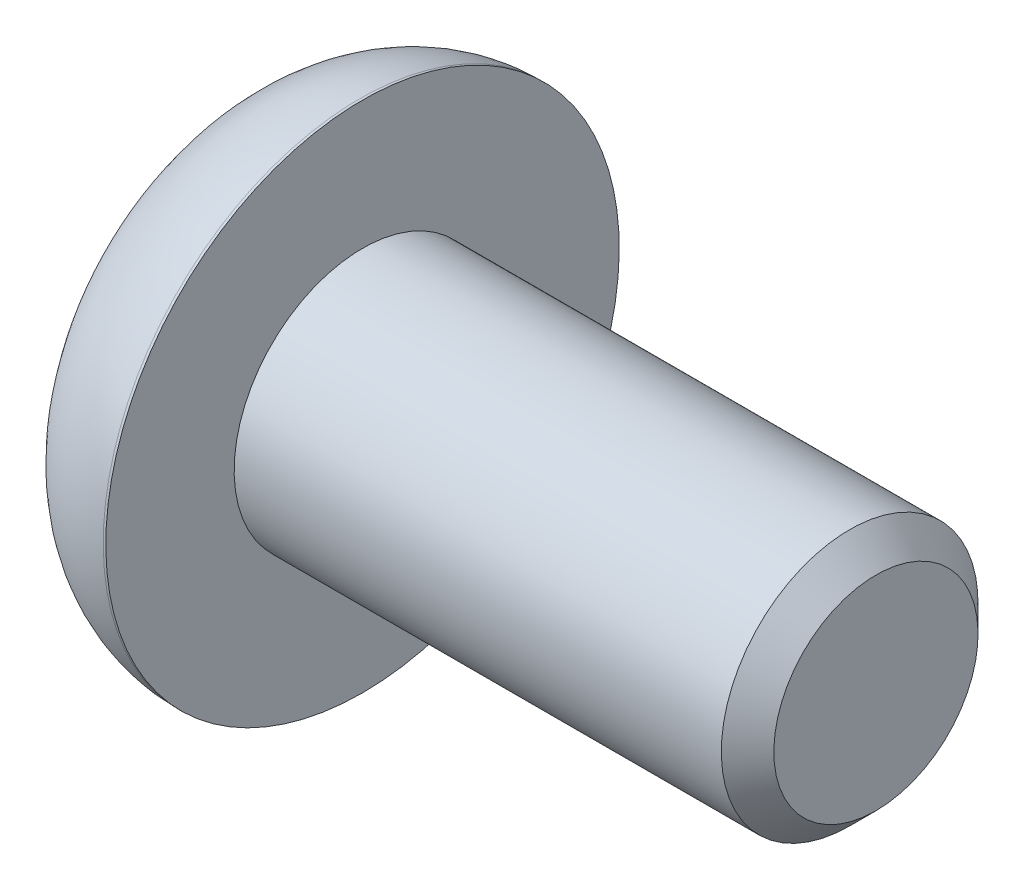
ISO-10303-21;
HEADER;
FILE_DESCRIPTION(('STEP AP214'),'2;1');
FILE_NAME('part.step','',(''),(''),'','','');
FILE_SCHEMA(('AUTOMOTIVE_DESIGN { 1 0 10303 214 1 1 1 1 }'));
ENDSEC;
DATA;
#1=APPLICATION_CONTEXT('core data for automotive mechanical design processes');
#2=APPLICATION_PROTOCOL_DEFINITION('international standard','automotive_design',2000,#1);
#3=PRODUCT_CONTEXT('',#1,'mechanical');
#4=PRODUCT('Part','Part','',(#3));
#5=PRODUCT_RELATED_PRODUCT_CATEGORY('part','',(#4));
#6=PRODUCT_DEFINITION_FORMATION('','',#4);
#7=PRODUCT_DEFINITION_CONTEXT('part definition',#1,'design');
#8=PRODUCT_DEFINITION('design','',#6,#7);
#9=PRODUCT_DEFINITION_SHAPE('','',#8);
#10=(LENGTH_UNIT() NAMED_UNIT(*) SI_UNIT(.MILLI.,.METRE.));
#11=(NAMED_UNIT(*) PLANE_ANGLE_UNIT() SI_UNIT($,.RADIAN.));
#12=(NAMED_UNIT(*) SI_UNIT($,.STERADIAN.) SOLID_ANGLE_UNIT());
#13=UNCERTAINTY_MEASURE_WITH_UNIT(LENGTH_MEASURE(1.E-05),#10,'distance_accuracy_value','');
#14=(GEOMETRIC_REPRESENTATION_CONTEXT(3) GLOBAL_UNCERTAINTY_ASSIGNED_CONTEXT((#13)) GLOBAL_UNIT_ASSIGNED_CONTEXT((#10,
#11,#12)) REPRESENTATION_CONTEXT('',''));
#15=CARTESIAN_POINT('',(0.,0.,0.));
#16=DIRECTION('',(0.,0.,1.));
#17=DIRECTION('',(1.,0.,0.));
#18=AXIS2_PLACEMENT_3D('',#15,#16,#17);
#19=CARTESIAN_POINT('',(0.,0.,0.));
#20=DIRECTION('',(1.,0.,0.));
#21=DIRECTION('',(0.,1.,0.));
#22=AXIS2_PLACEMENT_3D('',#19,#20,#21);
#23=PLANE('',#22);
#24=CARTESIAN_POINT('',(0.,0.,0.));
#25=DIRECTION('',(-1.,0.,0.));
#26=DIRECTION('',(0.,-1.,0.));
#27=AXIS2_PLACEMENT_3D('',#24,#25,#26);
#28=CIRCLE('',#27,2.76);
#29=CARTESIAN_POINT('',(0.,-2.76,0.));
#30=VERTEX_POINT('',#29);
#31=EDGE_CURVE('E162',#30,#30,#28,.T.);
#32=ORIENTED_EDGE('',*,*,#31,.T.);
#33=EDGE_LOOP('',(#32));
#34=FACE_BOUND('',#33,.T.);
#35=DIRECTION('',(0.,-0.5,-0.866025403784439));
#36=VECTOR('',#35,1.);
#37=CARTESIAN_POINT('',(0.,-1.15470053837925,2.));
#38=LINE('',#37,#36);
#39=CARTESIAN_POINT('',(0.,-1.15470053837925,2.));
#40=VERTEX_POINT('',#39);
#41=CARTESIAN_POINT('',(0.,-2.3094010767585,0.));
#42=VERTEX_POINT('',#41);
#43=EDGE_CURVE('E212',#40,#42,#38,.T.);
#44=ORIENTED_EDGE('',*,*,#43,.T.);
#45=DIRECTION('',(0.,0.5,-0.866025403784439));
#46=VECTOR('',#45,1.);
#47=CARTESIAN_POINT('',(0.,-2.3094010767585,0.));
#48=LINE('',#47,#46);
#49=CARTESIAN_POINT('',(0.,-1.15470053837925,-2.));
#50=VERTEX_POINT('',#49);
#51=EDGE_CURVE('E214',#42,#50,#48,.T.);
#52=ORIENTED_EDGE('',*,*,#51,.T.);
#53=DIRECTION('',(0.,1.,0.));
#54=VECTOR('',#53,1.);
#55=CARTESIAN_POINT('',(0.,-1.15470053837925,-2.));
#56=LINE('',#55,#54);
#57=CARTESIAN_POINT('',(0.,1.15470053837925,-2.));
#58=VERTEX_POINT('',#57);
#59=EDGE_CURVE('E216',#50,#58,#56,.T.);
#60=ORIENTED_EDGE('',*,*,#59,.T.);
#61=DIRECTION('',(0.,0.5,0.866025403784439));
#62=VECTOR('',#61,1.);
#63=CARTESIAN_POINT('',(0.,1.15470053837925,-2.));
#64=LINE('',#63,#62);
#65=CARTESIAN_POINT('',(0.,2.3094010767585,0.));
#66=VERTEX_POINT('',#65);
#67=EDGE_CURVE('E123',#58,#66,#64,.T.);
#68=ORIENTED_EDGE('',*,*,#67,.T.);
#69=DIRECTION('',(0.,-0.5,0.866025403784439));
#70=VECTOR('',#69,1.);
#71=CARTESIAN_POINT('',(0.,2.3094010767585,0.));
#72=LINE('',#71,#70);
#73=CARTESIAN_POINT('',(0.,1.15470053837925,2.));
#74=VERTEX_POINT('',#73);
#75=EDGE_CURVE('E209',#66,#74,#72,.T.);
#76=ORIENTED_EDGE('',*,*,#75,.T.);
#77=DIRECTION('',(0.,-1.,0.));
#78=VECTOR('',#77,1.);
#79=CARTESIAN_POINT('',(0.,1.15470053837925,2.));
#80=LINE('',#79,#78);
#81=EDGE_CURVE('E138',#74,#40,#80,.T.);
#82=ORIENTED_EDGE('',*,*,#81,.T.);
#83=EDGE_LOOP('',(#44,#52,#60,#68,#76,#82));
#84=FACE_BOUND('',#83,.T.);
#85=ADVANCED_FACE('F40',(#34,#84),#23,.F.);
#86=CARTESIAN_POINT('',(3.24000000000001,0.,0.));
#87=DIRECTION('',(-1.,0.,0.));
#88=DIRECTION('',(0.,-1.,0.));
#89=AXIS2_PLACEMENT_3D('',#86,#87,#88);
#90=DEGENERATE_TOROIDAL_SURFACE('',#89,2.75999999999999,3.24000000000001,.T.);
#91=ORIENTED_EDGE('',*,*,#31,.F.);
#92=EDGE_LOOP('',(#91));
#93=FACE_BOUND('',#92,.T.);
#94=CARTESIAN_POINT('',(3.24,0.,0.));
#95=DIRECTION('',(-1.,0.,0.));
#96=DIRECTION('',(0.,-1.,0.));
#97=AXIS2_PLACEMENT_3D('',#94,#95,#96);
#98=CIRCLE('',#97,6.);
#99=CARTESIAN_POINT('',(3.24,-6.,0.));
#100=VERTEX_POINT('',#99);
#101=EDGE_CURVE('E160',#100,#100,#98,.T.);
#102=ORIENTED_EDGE('',*,*,#101,.T.);
#103=EDGE_LOOP('',(#102));
#104=FACE_BOUND('',#103,.T.);
#105=ADVANCED_FACE('F250',(#93,#104),#90,.T.);
#106=CARTESIAN_POINT('',(15.3,0.,0.));
#107=DIRECTION('',(-1.,0.,0.));
#108=DIRECTION('',(0.,-1.,0.));
#109=AXIS2_PLACEMENT_3D('',#106,#107,#108);
#110=CYLINDRICAL_SURFACE('',#109,6.);
#111=ORIENTED_EDGE('',*,*,#101,.F.);
#112=EDGE_LOOP('',(#111));
#113=FACE_BOUND('',#112,.T.);
#114=CARTESIAN_POINT('',(3.3,0.,0.));
#115=DIRECTION('',(-1.,0.,0.));
#116=DIRECTION('',(0.,-1.,0.));
#117=AXIS2_PLACEMENT_3D('',#114,#115,#116);
#118=CIRCLE('',#117,6.);
#119=CARTESIAN_POINT('',(3.3,-6.,0.));
#120=VERTEX_POINT('',#119);
#121=EDGE_CURVE('E157',#120,#120,#118,.T.);
#122=ORIENTED_EDGE('',*,*,#121,.T.);
#123=EDGE_LOOP('',(#122));
#124=FACE_BOUND('',#123,.T.);
#125=ADVANCED_FACE('F254',(#113,#124),#110,.T.);
#126=CARTESIAN_POINT('',(3.3,6.,0.));
#127=DIRECTION('',(-1.,0.,0.));
#128=DIRECTION('',(0.,-1.,0.));
#129=AXIS2_PLACEMENT_3D('',#126,#127,#128);
#130=PLANE('',#129);
#131=ORIENTED_EDGE('',*,*,#121,.F.);
#132=EDGE_LOOP('',(#131));
#133=FACE_BOUND('',#132,.T.);
#134=CARTESIAN_POINT('',(3.3,0.,0.));
#135=DIRECTION('',(-1.,0.,0.));
#136=DIRECTION('',(0.,-1.,0.));
#137=AXIS2_PLACEMENT_3D('',#134,#135,#136);
#138=CIRCLE('',#137,3.);
#139=CARTESIAN_POINT('',(3.3,-3.,0.));
#140=VERTEX_POINT('',#139);
#141=EDGE_CURVE('E154',#140,#140,#138,.T.);
#142=ORIENTED_EDGE('',*,*,#141,.T.);
#143=EDGE_LOOP('',(#142));
#144=FACE_BOUND('',#143,.T.);
#145=ADVANCED_FACE('F259',(#133,#144),#130,.F.);
#146=CARTESIAN_POINT('',(15.3,0.,0.));
#147=DIRECTION('',(-1.,0.,0.));
#148=DIRECTION('',(0.,-1.,0.));
#149=AXIS2_PLACEMENT_3D('',#146,#147,#148);
#150=CYLINDRICAL_SURFACE('',#149,3.);
#151=ORIENTED_EDGE('',*,*,#141,.F.);
#152=EDGE_LOOP('',(#151));
#153=FACE_BOUND('',#152,.T.);
#154=CARTESIAN_POINT('',(14.6865,0.,0.));
#155=DIRECTION('',(-1.,0.,0.));
#156=DIRECTION('',(0.,-1.,0.));
#157=AXIS2_PLACEMENT_3D('',#154,#155,#156);
#158=CIRCLE('',#157,3.);
#159=CARTESIAN_POINT('',(14.6865,-3.,0.));
#160=VERTEX_POINT('',#159);
#161=EDGE_CURVE('E151',#160,#160,#158,.T.);
#162=ORIENTED_EDGE('',*,*,#161,.T.);
#163=EDGE_LOOP('',(#162));
#164=FACE_BOUND('',#163,.T.);
#165=ADVANCED_FACE('F266',(#153,#164),#150,.T.);
#166=CARTESIAN_POINT('',(15.3,0.,0.));
#167=DIRECTION('',(-1.,0.,0.));
#168=DIRECTION('',(0.,-1.,0.));
#169=AXIS2_PLACEMENT_3D('',#166,#167,#168);
#170=CONICAL_SURFACE('',#169,2.3865,0.785398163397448);
#171=ORIENTED_EDGE('',*,*,#161,.F.);
#172=EDGE_LOOP('',(#171));
#173=FACE_BOUND('',#172,.T.);
#174=CARTESIAN_POINT('',(15.3,0.,0.));
#175=DIRECTION('',(-1.,0.,0.));
#176=DIRECTION('',(0.,-1.,0.));
#177=AXIS2_PLACEMENT_3D('',#174,#175,#176);
#178=CIRCLE('',#177,2.3865);
#179=CARTESIAN_POINT('',(15.3,-2.3865,0.));
#180=VERTEX_POINT('',#179);
#181=EDGE_CURVE('E143',#180,#180,#178,.T.);
#182=ORIENTED_EDGE('',*,*,#181,.T.);
#183=EDGE_LOOP('',(#182));
#184=FACE_BOUND('',#183,.T.);
#185=ADVANCED_FACE('F270',(#173,#184),#170,.T.);
#186=CARTESIAN_POINT('',(15.3,2.3865,0.));
#187=DIRECTION('',(-1.,0.,0.));
#188=DIRECTION('',(0.,-1.,0.));
#189=AXIS2_PLACEMENT_3D('',#186,#187,#188);
#190=PLANE('',#189);
#191=ORIENTED_EDGE('',*,*,#181,.F.);
#192=EDGE_LOOP('',(#191));
#193=FACE_BOUND('',#192,.T.);
#194=ADVANCED_FACE('F274',(#193),#190,.F.);
#195=CARTESIAN_POINT('',(2.145,2.3094010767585,0.));
#196=DIRECTION('',(0.,-0.866025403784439,-0.5));
#197=DIRECTION('',(0.,0.5,-0.866025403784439));
#198=AXIS2_PLACEMENT_3D('',#195,#196,#197);
#199=PLANE('',#198);
#200=DIRECTION('',(0.,-0.5,0.866025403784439));
#201=VECTOR('',#200,1.);
#202=CARTESIAN_POINT('',(2.145,2.3094010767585,0.));
#203=LINE('',#202,#201);
#204=CARTESIAN_POINT('',(2.145,2.3094010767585,0.));
#205=VERTEX_POINT('',#204);
#206=CARTESIAN_POINT('',(2.145,1.73205080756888,1.));
#207=VERTEX_POINT('',#206);
#208=EDGE_CURVE('E120',#205,#207,#203,.T.);
#209=ORIENTED_EDGE('',*,*,#208,.T.);
#210=CARTESIAN_POINT('',(2.145,1.15470053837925,2.));
#211=VERTEX_POINT('',#210);
#212=EDGE_CURVE('E112',#207,#211,#203,.T.);
#213=ORIENTED_EDGE('',*,*,#212,.T.);
#214=DIRECTION('',(-1.,0.,0.));
#215=VECTOR('',#214,1.);
#216=CARTESIAN_POINT('',(2.145,1.15470053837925,2.));
#217=LINE('',#216,#215);
#218=EDGE_CURVE('E117',#211,#74,#217,.T.);
#219=ORIENTED_EDGE('',*,*,#218,.T.);
#220=ORIENTED_EDGE('',*,*,#75,.F.);
#221=DIRECTION('',(-1.,0.,0.));
#222=VECTOR('',#221,1.);
#223=CARTESIAN_POINT('',(2.145,2.3094010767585,0.));
#224=LINE('',#223,#222);
#225=EDGE_CURVE('E208',#205,#66,#224,.T.);
#226=ORIENTED_EDGE('',*,*,#225,.F.);
#227=EDGE_LOOP('',(#209,#213,#219,#220,#226));
#228=FACE_BOUND('',#227,.T.);
#229=ADVANCED_FACE('F114',(#228),#199,.T.);
#230=CARTESIAN_POINT('',(2.145,1.15470053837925,2.));
#231=DIRECTION('',(0.,0.,-1.));
#232=DIRECTION('',(-1.,0.,0.));
#233=AXIS2_PLACEMENT_3D('',#230,#231,#232);
#234=PLANE('',#233);
#235=DIRECTION('',(0.,-1.,0.));
#236=VECTOR('',#235,1.);
#237=CARTESIAN_POINT('',(2.145,1.15470053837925,2.));
#238=LINE('',#237,#236);
#239=CARTESIAN_POINT('',(2.145,0.,2.));
#240=VERTEX_POINT('',#239);
#241=EDGE_CURVE('E126',#211,#240,#238,.T.);
#242=ORIENTED_EDGE('',*,*,#241,.T.);
#243=CARTESIAN_POINT('',(2.145,-1.15470053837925,2.));
#244=VERTEX_POINT('',#243);
#245=EDGE_CURVE('E133',#240,#244,#238,.T.);
#246=ORIENTED_EDGE('',*,*,#245,.T.);
#247=DIRECTION('',(-1.,0.,0.));
#248=VECTOR('',#247,1.);
#249=CARTESIAN_POINT('',(2.145,-1.15470053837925,2.));
#250=LINE('',#249,#248);
#251=EDGE_CURVE('E140',#244,#40,#250,.T.);
#252=ORIENTED_EDGE('',*,*,#251,.T.);
#253=ORIENTED_EDGE('',*,*,#81,.F.);
#254=ORIENTED_EDGE('',*,*,#218,.F.);
#255=EDGE_LOOP('',(#242,#246,#252,#253,#254));
#256=FACE_BOUND('',#255,.T.);
#257=ADVANCED_FACE('F136',(#256),#234,.T.);
#258=CARTESIAN_POINT('',(2.145,-1.15470053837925,2.));
#259=DIRECTION('',(0.,0.866025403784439,-0.5));
#260=DIRECTION('',(0.,0.5,0.866025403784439));
#261=AXIS2_PLACEMENT_3D('',#258,#259,#260);
#262=PLANE('',#261);
#263=DIRECTION('',(0.,-0.5,-0.866025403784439));
#264=VECTOR('',#263,1.);
#265=CARTESIAN_POINT('',(2.145,-1.15470053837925,2.));
#266=LINE('',#265,#264);
#267=CARTESIAN_POINT('',(2.145,-1.73205080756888,1.));
#268=VERTEX_POINT('',#267);
#269=EDGE_CURVE('E232',#244,#268,#266,.T.);
#270=ORIENTED_EDGE('',*,*,#269,.T.);
#271=CARTESIAN_POINT('',(2.145,-2.3094010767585,0.));
#272=VERTEX_POINT('',#271);
#273=EDGE_CURVE('E132',#268,#272,#266,.T.);
#274=ORIENTED_EDGE('',*,*,#273,.T.);
#275=DIRECTION('',(-1.,0.,0.));
#276=VECTOR('',#275,1.);
#277=CARTESIAN_POINT('',(2.145,-2.3094010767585,0.));
#278=LINE('',#277,#276);
#279=EDGE_CURVE('E145',#272,#42,#278,.T.);
#280=ORIENTED_EDGE('',*,*,#279,.T.);
#281=ORIENTED_EDGE('',*,*,#43,.F.);
#282=ORIENTED_EDGE('',*,*,#251,.F.);
#283=EDGE_LOOP('',(#270,#274,#280,#281,#282));
#284=FACE_BOUND('',#283,.T.);
#285=ADVANCED_FACE('F228',(#284),#262,.T.);
#286=CARTESIAN_POINT('',(2.145,-2.3094010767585,0.));
#287=DIRECTION('',(0.,0.866025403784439,0.5));
#288=DIRECTION('',(0.,-0.5,0.866025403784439));
#289=AXIS2_PLACEMENT_3D('',#286,#287,#288);
#290=PLANE('',#289);
#291=DIRECTION('',(0.,0.5,-0.866025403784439));
#292=VECTOR('',#291,1.);
#293=CARTESIAN_POINT('',(2.145,-2.3094010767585,0.));
#294=LINE('',#293,#292);
#295=CARTESIAN_POINT('',(2.145,-1.73205080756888,-1.));
#296=VERTEX_POINT('',#295);
#297=EDGE_CURVE('E55',#272,#296,#294,.T.);
#298=ORIENTED_EDGE('',*,*,#297,.T.);
#299=CARTESIAN_POINT('',(2.145,-1.15470053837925,-2.));
#300=VERTEX_POINT('',#299);
#301=EDGE_CURVE('E234',#296,#300,#294,.T.);
#302=ORIENTED_EDGE('',*,*,#301,.T.);
#303=DIRECTION('',(-1.,0.,0.));
#304=VECTOR('',#303,1.);
#305=CARTESIAN_POINT('',(2.145,-1.15470053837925,-2.));
#306=LINE('',#305,#304);
#307=EDGE_CURVE('E203',#300,#50,#306,.T.);
#308=ORIENTED_EDGE('',*,*,#307,.T.);
#309=ORIENTED_EDGE('',*,*,#51,.F.);
#310=ORIENTED_EDGE('',*,*,#279,.F.);
#311=EDGE_LOOP('',(#298,#302,#308,#309,#310));
#312=FACE_BOUND('',#311,.T.);
#313=ADVANCED_FACE('F230',(#312),#290,.T.);
#314=CARTESIAN_POINT('',(2.145,-1.15470053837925,-2.));
#315=DIRECTION('',(0.,0.,1.));
#316=DIRECTION('',(1.,0.,0.));
#317=AXIS2_PLACEMENT_3D('',#314,#315,#316);
#318=PLANE('',#317);
#319=DIRECTION('',(0.,1.,0.));
#320=VECTOR('',#319,1.);
#321=CARTESIAN_POINT('',(2.145,-1.15470053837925,-2.));
#322=LINE('',#321,#320);
#323=CARTESIAN_POINT('',(2.145,0.,-2.));
#324=VERTEX_POINT('',#323);
#325=EDGE_CURVE('E197',#300,#324,#322,.T.);
#326=ORIENTED_EDGE('',*,*,#325,.T.);
#327=CARTESIAN_POINT('',(2.145,1.15470053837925,-2.));
#328=VERTEX_POINT('',#327);
#329=EDGE_CURVE('E192',#324,#328,#322,.T.);
#330=ORIENTED_EDGE('',*,*,#329,.T.);
#331=DIRECTION('',(-1.,0.,0.));
#332=VECTOR('',#331,1.);
#333=CARTESIAN_POINT('',(2.145,1.15470053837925,-2.));
#334=LINE('',#333,#332);
#335=EDGE_CURVE('E221',#328,#58,#334,.T.);
#336=ORIENTED_EDGE('',*,*,#335,.T.);
#337=ORIENTED_EDGE('',*,*,#59,.F.);
#338=ORIENTED_EDGE('',*,*,#307,.F.);
#339=EDGE_LOOP('',(#326,#330,#336,#337,#338));
#340=FACE_BOUND('',#339,.T.);
#341=ADVANCED_FACE('F200',(#340),#318,.T.);
#342=CARTESIAN_POINT('',(2.145,1.15470053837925,-2.));
#343=DIRECTION('',(0.,-0.866025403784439,0.5));
#344=DIRECTION('',(0.,-0.5,-0.866025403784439));
#345=AXIS2_PLACEMENT_3D('',#342,#343,#344);
#346=PLANE('',#345);
#347=DIRECTION('',(0.,0.5,0.866025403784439));
#348=VECTOR('',#347,1.);
#349=CARTESIAN_POINT('',(2.145,1.15470053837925,-2.));
#350=LINE('',#349,#348);
#351=CARTESIAN_POINT('',(2.145,1.73205080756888,-1.));
#352=VERTEX_POINT('',#351);
#353=EDGE_CURVE('E191',#328,#352,#350,.T.);
#354=ORIENTED_EDGE('',*,*,#353,.T.);
#355=EDGE_CURVE('E182',#352,#205,#350,.T.);
#356=ORIENTED_EDGE('',*,*,#355,.T.);
#357=ORIENTED_EDGE('',*,*,#225,.T.);
#358=ORIENTED_EDGE('',*,*,#67,.F.);
#359=ORIENTED_EDGE('',*,*,#335,.F.);
#360=EDGE_LOOP('',(#354,#356,#357,#358,#359));
#361=FACE_BOUND('',#360,.T.);
#362=ADVANCED_FACE('F248',(#361),#346,.T.);
#363=CARTESIAN_POINT('',(2.145,1.15470053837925,2.));
#364=DIRECTION('',(1.,0.,0.));
#365=DIRECTION('',(0.,0.,-1.));
#366=AXIS2_PLACEMENT_3D('',#363,#364,#365);
#367=PLANE('',#366);
#368=CARTESIAN_POINT('',(2.145,0.,0.));
#369=DIRECTION('',(1.,0.,0.));
#370=DIRECTION('',(0.,0.,-1.));
#371=AXIS2_PLACEMENT_3D('',#368,#369,#370);
#372=CIRCLE('',#371,2.);
#373=EDGE_CURVE('E11',#324,#352,#372,.T.);
#374=ORIENTED_EDGE('',*,*,#373,.T.);
#375=ORIENTED_EDGE('',*,*,#353,.F.);
#376=ORIENTED_EDGE('',*,*,#329,.F.);
#377=EDGE_LOOP('',(#374,#375,#376));
#378=FACE_BOUND('',#377,.T.);
#379=ADVANCED_FACE('F190',(#378),#367,.F.);
#380=EDGE_CURVE('E48',#352,#207,#372,.T.);
#381=ORIENTED_EDGE('',*,*,#380,.T.);
#382=ORIENTED_EDGE('',*,*,#208,.F.);
#383=ORIENTED_EDGE('',*,*,#355,.F.);
#384=EDGE_LOOP('',(#381,#382,#383));
#385=FACE_BOUND('',#384,.T.);
#386=ADVANCED_FACE('F181',(#385),#367,.F.);
#387=EDGE_CURVE('E128',#207,#240,#372,.T.);
#388=ORIENTED_EDGE('',*,*,#387,.T.);
#389=ORIENTED_EDGE('',*,*,#241,.F.);
#390=ORIENTED_EDGE('',*,*,#212,.F.);
#391=EDGE_LOOP('',(#388,#389,#390));
#392=FACE_BOUND('',#391,.T.);
#393=ADVANCED_FACE('F127',(#392),#367,.F.);
#394=EDGE_CURVE('E172',#240,#268,#372,.T.);
#395=ORIENTED_EDGE('',*,*,#394,.T.);
#396=ORIENTED_EDGE('',*,*,#269,.F.);
#397=ORIENTED_EDGE('',*,*,#245,.F.);
#398=EDGE_LOOP('',(#395,#396,#397));
#399=FACE_BOUND('',#398,.T.);
#400=ADVANCED_FACE('F233',(#399),#367,.F.);
#401=EDGE_CURVE('E166',#268,#296,#372,.T.);
#402=ORIENTED_EDGE('',*,*,#401,.T.);
#403=ORIENTED_EDGE('',*,*,#297,.F.);
#404=ORIENTED_EDGE('',*,*,#273,.F.);
#405=EDGE_LOOP('',(#402,#403,#404));
#406=FACE_BOUND('',#405,.T.);
#407=ADVANCED_FACE('F238',(#406),#367,.F.);
#408=EDGE_CURVE('E43',#296,#324,#372,.T.);
#409=ORIENTED_EDGE('',*,*,#408,.T.);
#410=ORIENTED_EDGE('',*,*,#325,.F.);
#411=ORIENTED_EDGE('',*,*,#301,.F.);
#412=EDGE_LOOP('',(#409,#410,#411));
#413=FACE_BOUND('',#412,.T.);
#414=ADVANCED_FACE('F235',(#413),#367,.F.);
#415=CARTESIAN_POINT('',(3.3,0.,0.));
#416=DIRECTION('',(-1.,0.,0.));
#417=DIRECTION('',(0.,0.,1.));
#418=AXIS2_PLACEMENT_3D('',#415,#416,#417);
#419=CONICAL_SURFACE('',#418,0.,1.0471975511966);
#420=CARTESIAN_POINT('',(2.14529946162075,0.,0.));
#421=DIRECTION('',(-1.,0.,0.));
#422=DIRECTION('',(0.,0.,1.));
#423=AXIS2_PLACEMENT_3D('',#420,#421,#422);
#424=CIRCLE('',#423,2.);
#425=CARTESIAN_POINT('',(2.14529946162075,0.,2.));
#426=VERTEX_POINT('',#425);
#427=EDGE_CURVE('E139',#426,#426,#424,.T.);
#428=ORIENTED_EDGE('',*,*,#427,.T.);
#429=EDGE_LOOP('',(#428));
#430=FACE_BOUND('',#429,.T.);
#431=CARTESIAN_POINT('',(3.3,0.,0.));
#432=VERTEX_POINT('',#431);
#433=VERTEX_LOOP('',#432);
#434=FACE_BOUND('',#433,.T.);
#435=ADVANCED_FACE('F237',(#430,#434),#419,.F.);
#436=CARTESIAN_POINT('',(3.3,0.,0.));
#437=DIRECTION('',(-1.,0.,0.));
#438=DIRECTION('',(0.,0.,1.));
#439=AXIS2_PLACEMENT_3D('',#436,#437,#438);
#440=CYLINDRICAL_SURFACE('',#439,2.);
#441=ORIENTED_EDGE('',*,*,#373,.F.);
#442=ORIENTED_EDGE('',*,*,#408,.F.);
#443=ORIENTED_EDGE('',*,*,#401,.F.);
#444=ORIENTED_EDGE('',*,*,#394,.F.);
#445=ORIENTED_EDGE('',*,*,#387,.F.);
#446=ORIENTED_EDGE('',*,*,#380,.F.);
#447=EDGE_LOOP('',(#441,#442,#443,#444,#445,#446));
#448=FACE_BOUND('',#447,.T.);
#449=ORIENTED_EDGE('',*,*,#427,.F.);
#450=EDGE_LOOP('',(#449));
#451=FACE_BOUND('',#450,.T.);
#452=ADVANCED_FACE('F186',(#448,#451),#440,.F.);
#453=CLOSED_SHELL('',(#85,#105,#125,#145,#165,#185,#194,#229,#257,#285,#313,#341,#362,#379,#386,
#393,#400,#407,#414,#435,#452));
#454=MANIFOLD_SOLID_BREP('B2',#453);
#455=ADVANCED_BREP_SHAPE_REPRESENTATION('',(#18,#454),#14);
#456=SHAPE_DEFINITION_REPRESENTATION(#9,#455);
ENDSEC;
END-ISO-10303-21;
